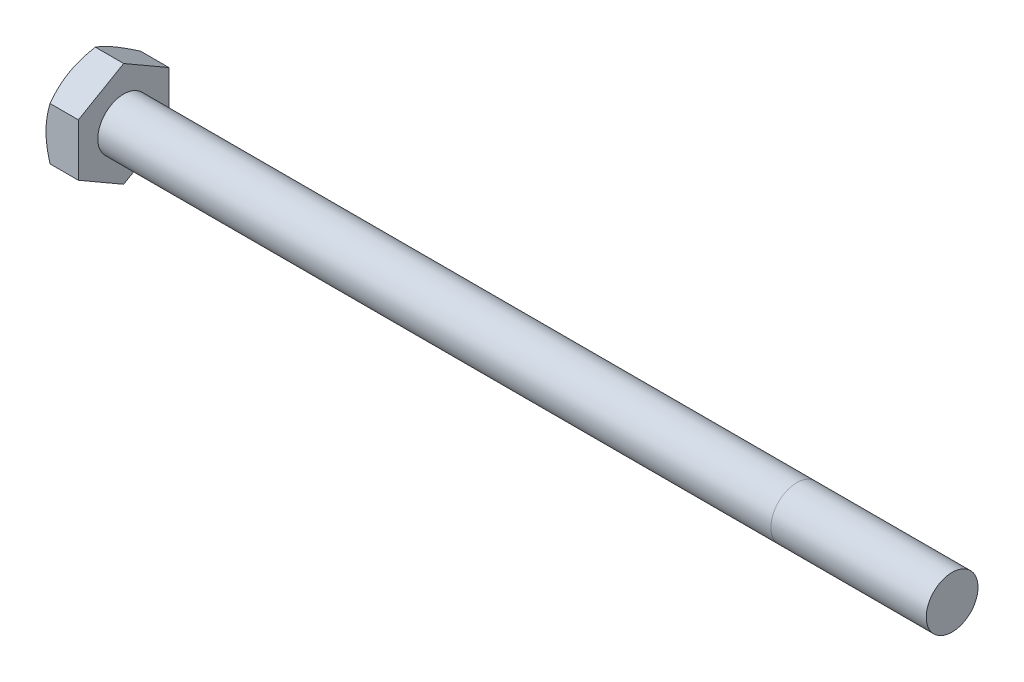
ISO-10303-21;
HEADER;
FILE_DESCRIPTION(('STEP AP214'),'2;1');
FILE_NAME('part.step','',(''),(''),'','','');
FILE_SCHEMA(('AUTOMOTIVE_DESIGN { 1 0 10303 214 1 1 1 1 }'));
ENDSEC;
DATA;
#1=APPLICATION_CONTEXT('core data for automotive mechanical design processes');
#2=APPLICATION_PROTOCOL_DEFINITION('international standard','automotive_design',2000,#1);
#3=PRODUCT_CONTEXT('',#1,'mechanical');
#4=PRODUCT('Part','Part','',(#3));
#5=PRODUCT_RELATED_PRODUCT_CATEGORY('part','',(#4));
#6=PRODUCT_DEFINITION_FORMATION('','',#4);
#7=PRODUCT_DEFINITION_CONTEXT('part definition',#1,'design');
#8=PRODUCT_DEFINITION('design','',#6,#7);
#9=PRODUCT_DEFINITION_SHAPE('','',#8);
#10=(LENGTH_UNIT() NAMED_UNIT(*) SI_UNIT(.MILLI.,.METRE.));
#11=(NAMED_UNIT(*) PLANE_ANGLE_UNIT() SI_UNIT($,.RADIAN.));
#12=(NAMED_UNIT(*) SI_UNIT($,.STERADIAN.) SOLID_ANGLE_UNIT());
#13=UNCERTAINTY_MEASURE_WITH_UNIT(LENGTH_MEASURE(1.E-05),#10,'distance_accuracy_value','');
#14=(GEOMETRIC_REPRESENTATION_CONTEXT(3) GLOBAL_UNCERTAINTY_ASSIGNED_CONTEXT((#13)) GLOBAL_UNIT_ASSIGNED_CONTEXT((#10,
#11,#12)) REPRESENTATION_CONTEXT('',''));
#15=CARTESIAN_POINT('',(0.,0.,0.));
#16=DIRECTION('',(0.,0.,1.));
#17=DIRECTION('',(1.,0.,0.));
#18=AXIS2_PLACEMENT_3D('',#15,#16,#17);
#19=CARTESIAN_POINT('',(-48.815625,0.,0.));
#20=DIRECTION('',(1.,0.,0.));
#21=DIRECTION('',(0.,0.,-1.));
#22=AXIS2_PLACEMENT_3D('',#19,#20,#21);
#23=CYLINDRICAL_SURFACE('',#22,3.175);
#24=CARTESIAN_POINT('',(52.784375,0.,0.));
#25=DIRECTION('',(1.,0.,0.));
#26=DIRECTION('',(0.,0.,-1.));
#27=AXIS2_PLACEMENT_3D('',#24,#25,#26);
#28=CIRCLE('',#27,3.175);
#29=CARTESIAN_POINT('',(52.784375,0.,-3.175));
#30=VERTEX_POINT('',#29);
#31=EDGE_CURVE('E384',#30,#30,#28,.T.);
#32=ORIENTED_EDGE('',*,*,#31,.F.);
#33=EDGE_LOOP('',(#32));
#34=FACE_BOUND('',#33,.T.);
#35=CARTESIAN_POINT('',(33.734375,0.,0.));
#36=DIRECTION('',(-1.,0.,0.));
#37=DIRECTION('',(0.,0.,1.));
#38=AXIS2_PLACEMENT_3D('',#35,#36,#37);
#39=CIRCLE('',#38,3.175);
#40=CARTESIAN_POINT('',(33.734375,0.,-3.175));
#41=VERTEX_POINT('',#40);
#42=CARTESIAN_POINT('',(33.734375,0.,3.175));
#43=VERTEX_POINT('',#42);
#44=EDGE_CURVE('E40',#41,#43,#39,.F.);
#45=ORIENTED_EDGE('',*,*,#44,.T.);
#46=EDGE_CURVE('E12',#43,#41,#39,.F.);
#47=ORIENTED_EDGE('',*,*,#46,.T.);
#48=EDGE_LOOP('',(#45,#47));
#49=FACE_BOUND('',#48,.T.);
#50=ADVANCED_FACE('F36',(#34,#49),#23,.T.);
#51=CARTESIAN_POINT('',(-52.784375,-3.20790243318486,5.55625));
#52=DIRECTION('',(0.,0.,-1.));
#53=DIRECTION('',(0.,1.,0.));
#54=AXIS2_PLACEMENT_3D('',#51,#52,#53);
#55=PLANE('',#54);
#56=CARTESIAN_POINT('',(-50.0245843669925,-8.71597197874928,5.55625));
#57=CARTESIAN_POINT('',(-50.1431276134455,-8.4724129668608,5.55625));
#58=CARTESIAN_POINT('',(-50.2605624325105,-8.22830532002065,5.55625));
#59=CARTESIAN_POINT('',(-50.4925936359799,-7.73870131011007,5.55625));
#60=CARTESIAN_POINT('',(-50.6071895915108,-7.49320474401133,5.55625));
#61=CARTESIAN_POINT('',(-50.8334767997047,-6.99931388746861,5.55625));
#62=CARTESIAN_POINT('',(-50.9451496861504,-6.75091115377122,5.55625));
#63=CARTESIAN_POINT('',(-51.1640550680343,-6.25216399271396,5.55625));
#64=CARTESIAN_POINT('',(-51.2712877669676,-6.00181965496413,5.55625));
#65=CARTESIAN_POINT('',(-51.4836259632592,-5.49040404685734,5.55625));
#66=CARTESIAN_POINT('',(-51.5885413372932,-5.22925341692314,5.55625));
#67=CARTESIAN_POINT('',(-51.7906690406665,-4.70393363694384,5.55625));
#68=CARTESIAN_POINT('',(-51.8878805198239,-4.43976415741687,5.55625));
#69=CARTESIAN_POINT('',(-52.072121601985,-3.90845027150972,5.55625));
#70=CARTESIAN_POINT('',(-52.1591709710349,-3.64131278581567,5.55625));
#71=CARTESIAN_POINT('',(-52.3203596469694,-3.10320429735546,5.55625));
#72=CARTESIAN_POINT('',(-52.3945029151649,-2.83223449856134,5.55625));
#73=CARTESIAN_POINT('',(-52.5259992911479,-2.28781102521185,5.55625));
#74=CARTESIAN_POINT('',(-52.5834450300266,-2.01438008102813,5.55625));
#75=CARTESIAN_POINT('',(-52.6783467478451,-1.46397793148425,5.55625));
#76=CARTESIAN_POINT('',(-52.7158048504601,-1.18700710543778,5.55625));
#77=CARTESIAN_POINT('',(-52.754519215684,-0.771839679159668,5.55625));
#78=CARTESIAN_POINT('',(-52.764501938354,-0.634423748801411,5.55625));
#79=CARTESIAN_POINT('',(-52.7786468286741,-0.359297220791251,5.55625));
#80=CARTESIAN_POINT('',(-52.7828095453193,-0.221586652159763,5.55625));
#81=CARTESIAN_POINT('',(-52.785210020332,0.0538978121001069,5.55625));
#82=CARTESIAN_POINT('',(-52.7834472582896,0.191671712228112,5.55625));
#83=CARTESIAN_POINT('',(-52.7740420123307,0.467008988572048,5.55625));
#84=CARTESIAN_POINT('',(-52.7663997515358,0.604572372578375,5.55625));
#85=CARTESIAN_POINT('',(-52.7413631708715,0.932168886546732,5.55625));
#86=CARTESIAN_POINT('',(-52.721346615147,1.12200607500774,5.55625));
#87=CARTESIAN_POINT('',(-52.6711855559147,1.50032750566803,5.55625));
#88=CARTESIAN_POINT('',(-52.6410397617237,1.68881157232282,5.55625));
#89=CARTESIAN_POINT('',(-52.5370024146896,2.25198169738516,5.55625));
#90=CARTESIAN_POINT('',(-52.4495274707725,2.62419475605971,5.55625));
#91=CARTESIAN_POINT('',(-52.2970938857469,3.18100797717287,5.55625));
#92=CARTESIAN_POINT('',(-52.241996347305,3.36847421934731,5.55625));
#93=CARTESIAN_POINT('',(-52.1258963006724,3.74158722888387,5.55625));
#94=CARTESIAN_POINT('',(-52.0648937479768,3.92723398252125,5.55625));
#95=CARTESIAN_POINT('',(-51.9379776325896,4.29676489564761,5.55625));
#96=CARTESIAN_POINT('',(-51.8720655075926,4.4806495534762,5.55625));
#97=CARTESIAN_POINT('',(-51.7361240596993,4.84688123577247,5.55625));
#98=CARTESIAN_POINT('',(-51.6660948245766,5.02922829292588,5.55625));
#99=CARTESIAN_POINT('',(-51.4751931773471,5.51260356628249,5.55625));
#100=CARTESIAN_POINT('',(-51.3513007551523,5.81243784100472,5.55625));
#101=CARTESIAN_POINT('',(-51.0964246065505,6.40908803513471,5.55625));
#102=CARTESIAN_POINT('',(-50.9654401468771,6.7059036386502,5.55625));
#103=CARTESIAN_POINT('',(-50.6980293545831,7.29719434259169,5.55625));
#104=CARTESIAN_POINT('',(-50.5616010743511,7.5916685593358,5.55625));
#105=CARTESIAN_POINT('',(-50.2845811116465,8.17863206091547,5.55625));
#106=CARTESIAN_POINT('',(-50.1439895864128,8.47112142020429,5.55625));
#107=CARTESIAN_POINT('',(-49.859318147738,9.05495036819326,5.55625));
#108=CARTESIAN_POINT('',(-49.7152332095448,9.34628750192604,5.55625));
#109=CARTESIAN_POINT('',(-49.4244465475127,9.92765328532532,5.55625));
#110=CARTESIAN_POINT('',(-49.2777448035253,10.2176819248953,5.55625));
#111=CARTESIAN_POINT('',(-48.8345640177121,11.0860438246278,5.55625));
#112=CARTESIAN_POINT('',(-48.5349489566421,11.6627758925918,5.55625));
#113=CARTESIAN_POINT('',(-47.9612850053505,12.7539662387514,5.55625));
#114=CARTESIAN_POINT('',(-47.6877850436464,13.2687144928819,5.55625));
#115=CARTESIAN_POINT('',(-47.1374510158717,14.2964629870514,5.55625));
#116=CARTESIAN_POINT('',(-46.8606167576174,14.8094631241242,5.55625));
#117=CARTESIAN_POINT('',(-46.3053732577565,15.8324606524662,5.55625));
#118=CARTESIAN_POINT('',(-46.0269720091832,16.3424623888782,5.55625));
#119=CARTESIAN_POINT('',(-45.4682670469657,17.3613731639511,5.55625));
#120=CARTESIAN_POINT('',(-45.1879634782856,17.8702822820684,5.55625));
#121=CARTESIAN_POINT('',(-44.9069657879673,18.3788054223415,5.55625));
#122=B_SPLINE_CURVE_WITH_KNOTS('',3,(#56,#57,#58,#59,#60,#61,#62,#63,#64,#65,#66,#67,#68,#69,
#70,#71,#72,#73,#74,#75,#76,#77,#78,#79,#80,#81,#82,#83,#84,#85,#86,#87,#88,#89,#90,#91,#92,#93,
#94,#95,#96,#97,#98,#99,#100,#101,#102,#103,#104,#105,#106,#107,#108,#109,#110,#111,#112,#113,
#114,#115,#116,#117,#118,#119,#120,#121),.UNSPECIFIED.,.F.,.F.,(4,2,2,2,2,2,2,2,2,2,2,2,2,2,2,2,
2,2,2,2,2,2,2,2,2,2,2,2,2,2,2,2,4),(0.,0.812635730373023,1.62539348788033,2.44240990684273,
3.25938884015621,4.103606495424,4.9479171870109,5.79055726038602,6.63293824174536,
7.47055271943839,8.30807818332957,8.72130785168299,9.13449853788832,9.54772551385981,
9.96093680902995,10.5332843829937,11.1057049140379,12.2511183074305,12.8372525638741,
13.4233912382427,14.0093589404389,14.5953141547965,15.5684465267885,16.541679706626,
17.5152642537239,18.4888120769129,19.4638547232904,20.4389048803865,22.3885945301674,
24.1372706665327,25.886048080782,27.6291677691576,29.3721560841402),.UNSPECIFIED.);
#123=CARTESIAN_POINT('',(-52.2881107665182,-3.20790243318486,5.55625));
#124=VERTEX_POINT('',#123);
#125=CARTESIAN_POINT('',(-52.784375,0.,5.55625));
#126=VERTEX_POINT('',#125);
#127=EDGE_CURVE('E434',#124,#126,#122,.T.);
#128=ORIENTED_EDGE('',*,*,#127,.F.);
#129=DIRECTION('',(1.,0.,0.));
#130=VECTOR('',#129,1.);
#131=CARTESIAN_POINT('',(-52.784375,-3.20790243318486,5.55625));
#132=LINE('',#131,#130);
#133=CARTESIAN_POINT('',(-48.815625,-3.20790243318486,5.55625));
#134=VERTEX_POINT('',#133);
#135=EDGE_CURVE('E416',#124,#134,#132,.T.);
#136=ORIENTED_EDGE('',*,*,#135,.T.);
#137=DIRECTION('',(0.,1.,0.));
#138=VECTOR('',#137,1.);
#139=CARTESIAN_POINT('',(-48.815625,-3.20790243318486,5.55625));
#140=LINE('',#139,#138);
#141=CARTESIAN_POINT('',(-48.815625,3.20790243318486,5.55625));
#142=VERTEX_POINT('',#141);
#143=EDGE_CURVE('E432',#134,#142,#140,.T.);
#144=ORIENTED_EDGE('',*,*,#143,.T.);
#145=DIRECTION('',(1.,0.,0.));
#146=VECTOR('',#145,1.);
#147=CARTESIAN_POINT('',(-52.784375,3.20790243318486,5.55625));
#148=LINE('',#147,#146);
#149=CARTESIAN_POINT('',(-52.2881107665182,3.20790243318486,5.55625));
#150=VERTEX_POINT('',#149);
#151=EDGE_CURVE('E404',#150,#142,#148,.T.);
#152=ORIENTED_EDGE('',*,*,#151,.F.);
#153=EDGE_CURVE('E324',#126,#150,#122,.T.);
#154=ORIENTED_EDGE('',*,*,#153,.F.);
#155=EDGE_LOOP('',(#128,#136,#144,#152,#154));
#156=FACE_BOUND('',#155,.T.);
#157=ADVANCED_FACE('F365',(#156),#55,.F.);
#158=CARTESIAN_POINT('',(-52.784375,3.20790243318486,5.55625));
#159=DIRECTION('',(0.,-0.866025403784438,-0.5));
#160=DIRECTION('',(0.,0.5,-0.866025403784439));
#161=AXIS2_PLACEMENT_3D('',#158,#159,#160);
#162=PLANE('',#161);
#163=CARTESIAN_POINT('',(-52.2880440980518,3.20778696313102,5.55645));
#164=CARTESIAN_POINT('',(-52.3287494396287,3.27830048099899,5.43431700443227));
#165=CARTESIAN_POINT('',(-52.3676074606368,3.34907690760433,5.31172863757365));
#166=CARTESIAN_POINT('',(-52.4411200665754,3.49120454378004,5.06555635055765));
#167=CARTESIAN_POINT('',(-52.4757728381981,3.56255598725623,4.94197202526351));
#168=CARTESIAN_POINT('',(-52.5727431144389,3.7777527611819,4.56924027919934));
#169=CARTESIAN_POINT('',(-52.627898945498,3.92244755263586,4.3186215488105));
#170=CARTESIAN_POINT('',(-52.692576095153,4.13898067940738,3.94357517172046));
#171=CARTESIAN_POINT('',(-52.7110008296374,4.21017202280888,3.82026814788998));
#172=CARTESIAN_POINT('',(-52.7418966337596,4.35287639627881,3.57309692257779));
#173=CARTESIAN_POINT('',(-52.754368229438,4.42438939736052,3.44923277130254));
#174=CARTESIAN_POINT('',(-52.7730399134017,4.56753961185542,3.20128932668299));
#175=CARTESIAN_POINT('',(-52.7792471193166,4.63917659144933,3.07721043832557));
#176=CARTESIAN_POINT('',(-52.7852635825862,4.7825127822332,2.82894487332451));
#177=CARTESIAN_POINT('',(-52.7850730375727,4.85421199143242,2.70475820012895));
#178=CARTESIAN_POINT('',(-52.7757567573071,5.05064720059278,2.3645224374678));
#179=CARTESIAN_POINT('',(-52.7601153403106,5.1753189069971,2.14858470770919));
#180=CARTESIAN_POINT('',(-52.7105150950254,5.42383425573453,1.71814349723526));
#181=CARTESIAN_POINT('',(-52.6765393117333,5.54767702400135,1.50364153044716));
#182=CARTESIAN_POINT('',(-52.5916092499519,5.79669255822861,1.07233397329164));
#183=CARTESIAN_POINT('',(-52.5402951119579,5.92183390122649,0.8555828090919));
#184=CARTESIAN_POINT('',(-52.4238325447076,6.17025031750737,0.425312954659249));
#185=CARTESIAN_POINT('',(-52.3587114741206,6.29352857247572,0.211788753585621));
#186=CARTESIAN_POINT('',(-52.2880440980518,6.41592033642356,-0.00020000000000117));
#187=B_SPLINE_CURVE_WITH_KNOTS('',3,(#163,#164,#165,#166,#167,#168,#169,#170,#171,#172,#173,
#174,#175,#176,#177,#178,#179,#180,#181,#182,#183,#184,#185,#186),.UNSPECIFIED.,.F.,.F.,(4,2,2,
2,2,2,2,2,2,2,2,4),(0.,0.440316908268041,0.880823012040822,1.76366572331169,2.19427472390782,
2.62484566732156,3.05492684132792,3.48499472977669,4.23370964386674,4.98311813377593,
5.74914806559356,6.51367405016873),.UNSPECIFIED.);
#188=CARTESIAN_POINT('',(-52.784375,4.81185364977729,2.778125));
#189=VERTEX_POINT('',#188);
#190=EDGE_CURVE('E439',#150,#189,#187,.T.);
#191=ORIENTED_EDGE('',*,*,#190,.F.);
#192=ORIENTED_EDGE('',*,*,#151,.T.);
#193=DIRECTION('',(0.,0.5,-0.866025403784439));
#194=VECTOR('',#193,1.);
#195=CARTESIAN_POINT('',(-48.815625,3.20790243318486,5.55625));
#196=LINE('',#195,#194);
#197=CARTESIAN_POINT('',(-48.815625,6.41580486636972,0.));
#198=VERTEX_POINT('',#197);
#199=EDGE_CURVE('E430',#142,#198,#196,.T.);
#200=ORIENTED_EDGE('',*,*,#199,.T.);
#201=DIRECTION('',(1.,0.,0.));
#202=VECTOR('',#201,1.);
#203=CARTESIAN_POINT('',(-52.784375,6.41580486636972,0.));
#204=LINE('',#203,#202);
#205=CARTESIAN_POINT('',(-52.2881107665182,6.41580486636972,0.));
#206=VERTEX_POINT('',#205);
#207=EDGE_CURVE('E408',#206,#198,#204,.T.);
#208=ORIENTED_EDGE('',*,*,#207,.F.);
#209=EDGE_CURVE('E350',#189,#206,#187,.T.);
#210=ORIENTED_EDGE('',*,*,#209,.F.);
#211=EDGE_LOOP('',(#191,#192,#200,#208,#210));
#212=FACE_BOUND('',#211,.T.);
#213=ADVANCED_FACE('F360',(#212),#162,.F.);
#214=CARTESIAN_POINT('',(-52.784375,6.41580486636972,0.));
#215=DIRECTION('',(0.,-0.866025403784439,0.5));
#216=DIRECTION('',(0.,-0.5,-0.866025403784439));
#217=AXIS2_PLACEMENT_3D('',#214,#215,#216);
#218=PLANE('',#217);
#219=CARTESIAN_POINT('',(-52.2880440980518,6.41592033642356,0.000199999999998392));
#220=CARTESIAN_POINT('',(-52.3287494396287,6.34540681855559,-0.121932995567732));
#221=CARTESIAN_POINT('',(-52.3676074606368,6.27463039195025,-0.244521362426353));
#222=CARTESIAN_POINT('',(-52.4411200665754,6.13250275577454,-0.490693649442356));
#223=CARTESIAN_POINT('',(-52.4757728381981,6.06115131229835,-0.614277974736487));
#224=CARTESIAN_POINT('',(-52.5727431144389,5.84595453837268,-0.987009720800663));
#225=CARTESIAN_POINT('',(-52.6278989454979,5.70125974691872,-1.2376284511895));
#226=CARTESIAN_POINT('',(-52.692576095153,5.4847266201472,-1.61267482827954));
#227=CARTESIAN_POINT('',(-52.7110008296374,5.41353527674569,-1.73598185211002));
#228=CARTESIAN_POINT('',(-52.7418966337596,5.27083090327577,-1.98315307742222));
#229=CARTESIAN_POINT('',(-52.754368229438,5.19931790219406,-2.10701722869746));
#230=CARTESIAN_POINT('',(-52.7730399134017,5.05616768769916,-2.35496067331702));
#231=CARTESIAN_POINT('',(-52.7792471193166,4.98453070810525,-2.47903956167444));
#232=CARTESIAN_POINT('',(-52.7852635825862,4.84119451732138,-2.72730512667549));
#233=CARTESIAN_POINT('',(-52.7850730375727,4.76949530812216,-2.85149179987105));
#234=CARTESIAN_POINT('',(-52.7757567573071,4.5730600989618,-3.19172756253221));
#235=CARTESIAN_POINT('',(-52.7601153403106,4.44838839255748,-3.40766529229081));
#236=CARTESIAN_POINT('',(-52.7105150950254,4.19987304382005,-3.83810650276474));
#237=CARTESIAN_POINT('',(-52.6765393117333,4.07603027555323,-4.05260846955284));
#238=CARTESIAN_POINT('',(-52.5916092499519,3.82701474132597,-4.48391602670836));
#239=CARTESIAN_POINT('',(-52.5402951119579,3.70187339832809,-4.7006671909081));
#240=CARTESIAN_POINT('',(-52.4238325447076,3.45345698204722,-5.13093704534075));
#241=CARTESIAN_POINT('',(-52.3587114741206,3.33017872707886,-5.34446124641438));
#242=CARTESIAN_POINT('',(-52.2880440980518,3.20778696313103,-5.55645));
#243=B_SPLINE_CURVE_WITH_KNOTS('',3,(#219,#220,#221,#222,#223,#224,#225,#226,#227,#228,#229,
#230,#231,#232,#233,#234,#235,#236,#237,#238,#239,#240,#241,#242),.UNSPECIFIED.,.F.,.F.,(4,2,2,
2,2,2,2,2,2,2,2,4),(0.,0.440316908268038,0.88082301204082,1.76366572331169,2.19427472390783,
2.62484566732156,3.05492684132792,3.48499472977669,4.23370964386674,4.98311813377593,
5.74914806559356,6.51367405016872),.UNSPECIFIED.);
#244=CARTESIAN_POINT('',(-52.784375,4.81185364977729,-2.778125));
#245=VERTEX_POINT('',#244);
#246=EDGE_CURVE('E348',#206,#245,#243,.T.);
#247=ORIENTED_EDGE('',*,*,#246,.F.);
#248=ORIENTED_EDGE('',*,*,#207,.T.);
#249=DIRECTION('',(0.,-0.5,-0.866025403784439));
#250=VECTOR('',#249,1.);
#251=CARTESIAN_POINT('',(-48.815625,6.41580486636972,0.));
#252=LINE('',#251,#250);
#253=CARTESIAN_POINT('',(-48.815625,3.20790243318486,-5.55625));
#254=VERTEX_POINT('',#253);
#255=EDGE_CURVE('E427',#198,#254,#252,.T.);
#256=ORIENTED_EDGE('',*,*,#255,.T.);
#257=DIRECTION('',(1.,0.,0.));
#258=VECTOR('',#257,1.);
#259=CARTESIAN_POINT('',(-52.784375,3.20790243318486,-5.55625));
#260=LINE('',#259,#258);
#261=CARTESIAN_POINT('',(-52.2881107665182,3.20790243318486,-5.55625));
#262=VERTEX_POINT('',#261);
#263=EDGE_CURVE('E410',#262,#254,#260,.T.);
#264=ORIENTED_EDGE('',*,*,#263,.F.);
#265=EDGE_CURVE('E342',#245,#262,#243,.T.);
#266=ORIENTED_EDGE('',*,*,#265,.F.);
#267=EDGE_LOOP('',(#247,#248,#256,#264,#266));
#268=FACE_BOUND('',#267,.T.);
#269=ADVANCED_FACE('F356',(#268),#218,.F.);
#270=CARTESIAN_POINT('',(-52.784375,3.20790243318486,-5.55625));
#271=DIRECTION('',(0.,0.,1.));
#272=DIRECTION('',(0.,-1.,0.));
#273=AXIS2_PLACEMENT_3D('',#270,#271,#272);
#274=PLANE('',#273);
#275=CARTESIAN_POINT('',(-50.024584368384,-8.71597197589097,-5.55625));
#276=CARTESIAN_POINT('',(-50.143127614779,-8.47241296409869,-5.55625));
#277=CARTESIAN_POINT('',(-50.260562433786,-8.22830531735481,-5.55625));
#278=CARTESIAN_POINT('',(-50.4925936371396,-7.73870130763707,-5.55625));
#279=CARTESIAN_POINT('',(-50.6071895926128,-7.4932047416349,-5.55625));
#280=CARTESIAN_POINT('',(-50.8334768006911,-6.99931388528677,-5.55625));
#281=CARTESIAN_POINT('',(-50.9451496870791,-6.75091115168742,-5.55625));
#282=CARTESIAN_POINT('',(-51.1640550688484,-6.25216399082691,-5.55625));
#283=CARTESIAN_POINT('',(-51.2712877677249,-6.00181965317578,-5.55625));
#284=CARTESIAN_POINT('',(-51.4836259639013,-5.49040404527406,-5.55625));
#285=CARTESIAN_POINT('',(-51.5885413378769,-5.22925341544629,-5.55625));
#286=CARTESIAN_POINT('',(-51.7906690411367,-4.70393363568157,-5.55625));
#287=CARTESIAN_POINT('',(-51.8878805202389,-4.43976415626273,-5.55625));
#288=CARTESIAN_POINT('',(-52.0721216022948,-3.90845027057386,-5.55625));
#289=CARTESIAN_POINT('',(-52.1591709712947,-3.64131278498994,-5.55625));
#290=CARTESIAN_POINT('',(-52.3203596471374,-3.103204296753,-5.55625));
#291=CARTESIAN_POINT('',(-52.394502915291,-2.83223449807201,-5.55625));
#292=CARTESIAN_POINT('',(-52.5259992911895,-2.28781102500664,-5.55625));
#293=CARTESIAN_POINT('',(-52.5834450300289,-2.01438008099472,-5.55625));
#294=CARTESIAN_POINT('',(-52.6783467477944,-1.46397793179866,-5.55625));
#295=CARTESIAN_POINT('',(-52.7158048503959,-1.18700710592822,-5.55625));
#296=CARTESIAN_POINT('',(-52.7545192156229,-0.77183967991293,-5.55625));
#297=CARTESIAN_POINT('',(-52.7645019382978,-0.634423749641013,-5.55625));
#298=CARTESIAN_POINT('',(-52.7786468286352,-0.359297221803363,-5.55625));
#299=CARTESIAN_POINT('',(-52.7828095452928,-0.221586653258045,-5.55625));
#300=CARTESIAN_POINT('',(-52.7852100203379,0.0538978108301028,-5.55625));
#301=CARTESIAN_POINT('',(-52.7834472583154,0.191671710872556,-5.55625));
#302=CARTESIAN_POINT('',(-52.7740420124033,0.467008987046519,-5.55625));
#303=CARTESIAN_POINT('',(-52.7663997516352,0.604572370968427,-5.55625));
#304=CARTESIAN_POINT('',(-52.7413631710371,0.932168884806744,-5.55625));
#305=CARTESIAN_POINT('',(-52.7213466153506,1.1220060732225,-5.55625));
#306=CARTESIAN_POINT('',(-52.6711855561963,1.50032750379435,-5.55625));
#307=CARTESIAN_POINT('',(-52.6410397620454,1.68881157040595,-5.55625));
#308=CARTESIAN_POINT('',(-52.5370024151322,2.25198169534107,-5.55625));
#309=CARTESIAN_POINT('',(-52.4495274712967,2.62419475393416,-5.55625));
#310=CARTESIAN_POINT('',(-52.2970938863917,3.18100797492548,-5.55625));
#311=CARTESIAN_POINT('',(-52.2419963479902,3.36847421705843,-5.55625));
#312=CARTESIAN_POINT('',(-52.1258963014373,3.74158722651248,-5.55625));
#313=CARTESIAN_POINT('',(-52.0648937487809,3.92723398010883,-5.55625));
#314=CARTESIAN_POINT('',(-51.9379776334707,4.29676489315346,-5.55625));
#315=CARTESIAN_POINT('',(-51.8720655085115,4.48064955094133,-5.55625));
#316=CARTESIAN_POINT('',(-51.7361240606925,4.84688123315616,-5.55625));
#317=CARTESIAN_POINT('',(-51.6660948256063,5.02922829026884,-5.55625));
#318=CARTESIAN_POINT('',(-51.4751931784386,5.51260356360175,-5.55625));
#319=CARTESIAN_POINT('',(-51.3513007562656,5.81243783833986,-5.55625));
#320=CARTESIAN_POINT('',(-51.0964246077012,6.40908803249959,-5.55625));
#321=CARTESIAN_POINT('',(-50.9654401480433,6.70590363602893,-5.55625));
#322=CARTESIAN_POINT('',(-50.6980293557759,7.29719433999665,-5.55625));
#323=CARTESIAN_POINT('',(-50.5616010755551,7.59166855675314,-5.55625));
#324=CARTESIAN_POINT('',(-50.2845811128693,8.17863205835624,-5.55625));
#325=CARTESIAN_POINT('',(-50.1439895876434,8.47112141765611,-5.55625));
#326=CARTESIAN_POINT('',(-49.8593181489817,9.05495036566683,-5.55625));
#327=CARTESIAN_POINT('',(-49.7152332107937,9.34628749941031,-5.55625));
#328=CARTESIAN_POINT('',(-49.4244465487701,9.92765328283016,-5.55625));
#329=CARTESIAN_POINT('',(-49.2777448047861,10.2176819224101,-5.55625));
#330=CARTESIAN_POINT('',(-48.8345640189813,11.086043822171,-5.55625));
#331=CARTESIAN_POINT('',(-48.5349489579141,11.6627758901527,-5.55625));
#332=CARTESIAN_POINT('',(-47.9612850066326,12.75396623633,-5.55625));
#333=CARTESIAN_POINT('',(-47.6877850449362,13.2687144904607,-5.55625));
#334=CARTESIAN_POINT('',(-47.1374510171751,14.2964629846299,-5.55625));
#335=CARTESIAN_POINT('',(-46.8606167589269,14.8094631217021,-5.55625));
#336=CARTESIAN_POINT('',(-46.3053732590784,15.8324606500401,-5.55625));
#337=CARTESIAN_POINT('',(-46.0269720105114,16.3424623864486,-5.55625));
#338=CARTESIAN_POINT('',(-45.4682670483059,17.3613731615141,-5.55625));
#339=CARTESIAN_POINT('',(-45.1879634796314,17.8702822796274,-5.55625));
#340=CARTESIAN_POINT('',(-44.9069657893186,18.3788054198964,-5.55625));
#341=B_SPLINE_CURVE_WITH_KNOTS('',3,(#275,#276,#277,#278,#279,#280,#281,#282,#283,#284,#285,
#286,#287,#288,#289,#290,#291,#292,#293,#294,#295,#296,#297,#298,#299,#300,#301,#302,#303,#304,
#305,#306,#307,#308,#309,#310,#311,#312,#313,#314,#315,#316,#317,#318,#319,#320,#321,#322,#323,
#324,#325,#326,#327,#328,#329,#330,#331,#332,#333,#334,#335,#336,#337,#338,#339,#340),
.UNSPECIFIED.,.F.,.F.,(4,2,2,2,2,2,2,2,2,2,2,2,2,2,2,2,2,2,2,2,2,2,2,2,2,2,2,2,2,2,2,2,4),(0.,
0.812635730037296,1.62539348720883,2.44240990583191,3.25938883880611,4.10360649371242,
4.94791718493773,5.79055725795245,6.63293823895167,7.4705527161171,8.30807817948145,
8.72130784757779,9.13449853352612,9.54772550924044,9.96093680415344,10.5332843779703,
11.1057049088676,12.2511183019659,12.8372525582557,13.4233912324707,14.0093589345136,
14.5953141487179,15.5684465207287,16.5416797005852,17.5152642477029,18.4888120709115,
19.4638547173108,20.4389048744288,22.3885945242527,24.1372706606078,25.8860480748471,
27.6291677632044,29.3721560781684),.UNSPECIFIED.);
#342=CARTESIAN_POINT('',(-52.784375,0.,-5.55625));
#343=VERTEX_POINT('',#342);
#344=EDGE_CURVE('E349',#262,#343,#341,.F.);
#345=ORIENTED_EDGE('',*,*,#344,.F.);
#346=ORIENTED_EDGE('',*,*,#263,.T.);
#347=DIRECTION('',(0.,-1.,0.));
#348=VECTOR('',#347,1.);
#349=CARTESIAN_POINT('',(-48.815625,3.20790243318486,-5.55625));
#350=LINE('',#349,#348);
#351=CARTESIAN_POINT('',(-48.815625,-3.20790243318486,-5.55625));
#352=VERTEX_POINT('',#351);
#353=EDGE_CURVE('E424',#254,#352,#350,.T.);
#354=ORIENTED_EDGE('',*,*,#353,.T.);
#355=DIRECTION('',(1.,0.,0.));
#356=VECTOR('',#355,1.);
#357=CARTESIAN_POINT('',(-52.784375,-3.20790243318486,-5.55625));
#358=LINE('',#357,#356);
#359=CARTESIAN_POINT('',(-52.2881107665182,-3.20790243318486,-5.55625));
#360=VERTEX_POINT('',#359);
#361=EDGE_CURVE('E412',#360,#352,#358,.T.);
#362=ORIENTED_EDGE('',*,*,#361,.F.);
#363=EDGE_CURVE('E335',#343,#360,#341,.F.);
#364=ORIENTED_EDGE('',*,*,#363,.F.);
#365=EDGE_LOOP('',(#345,#346,#354,#362,#364));
#366=FACE_BOUND('',#365,.T.);
#367=ADVANCED_FACE('F359',(#366),#274,.F.);
#368=CARTESIAN_POINT('',(-52.784375,-3.20790243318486,-5.55625));
#369=DIRECTION('',(0.,0.866025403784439,0.5));
#370=DIRECTION('',(0.,-0.5,0.866025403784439));
#371=AXIS2_PLACEMENT_3D('',#368,#369,#370);
#372=PLANE('',#371);
#373=CARTESIAN_POINT('',(-52.2880440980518,-3.20778696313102,-5.55645));
#374=CARTESIAN_POINT('',(-52.3287494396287,-3.27830048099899,-5.43431700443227));
#375=CARTESIAN_POINT('',(-52.3676074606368,-3.34907690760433,-5.31172863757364));
#376=CARTESIAN_POINT('',(-52.4411200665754,-3.49120454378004,-5.06555635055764));
#377=CARTESIAN_POINT('',(-52.4757728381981,-3.56255598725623,-4.94197202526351));
#378=CARTESIAN_POINT('',(-52.5727431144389,-3.7777527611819,-4.56924027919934));
#379=CARTESIAN_POINT('',(-52.627898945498,-3.92244755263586,-4.3186215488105));
#380=CARTESIAN_POINT('',(-52.692576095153,-4.13898067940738,-3.94357517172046));
#381=CARTESIAN_POINT('',(-52.7110008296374,-4.21017202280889,-3.82026814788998));
#382=CARTESIAN_POINT('',(-52.7418966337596,-4.35287639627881,-3.57309692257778));
#383=CARTESIAN_POINT('',(-52.754368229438,-4.42438939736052,-3.44923277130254));
#384=CARTESIAN_POINT('',(-52.7730399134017,-4.56753961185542,-3.20128932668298));
#385=CARTESIAN_POINT('',(-52.7792471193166,-4.63917659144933,-3.07721043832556));
#386=CARTESIAN_POINT('',(-52.7852635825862,-4.7825127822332,-2.82894487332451));
#387=CARTESIAN_POINT('',(-52.7850730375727,-4.85421199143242,-2.70475820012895));
#388=CARTESIAN_POINT('',(-52.7757567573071,-5.05064720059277,-2.36452243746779));
#389=CARTESIAN_POINT('',(-52.7601153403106,-5.1753189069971,-2.14858470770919));
#390=CARTESIAN_POINT('',(-52.7105150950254,-5.42383425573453,-1.71814349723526));
#391=CARTESIAN_POINT('',(-52.6765393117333,-5.54767702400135,-1.50364153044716));
#392=CARTESIAN_POINT('',(-52.5916092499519,-5.79669255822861,-1.07233397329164));
#393=CARTESIAN_POINT('',(-52.5402951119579,-5.92183390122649,-0.855582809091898));
#394=CARTESIAN_POINT('',(-52.4238325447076,-6.17025031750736,-0.425312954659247));
#395=CARTESIAN_POINT('',(-52.3587114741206,-6.29352857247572,-0.211788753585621));
#396=CARTESIAN_POINT('',(-52.2880440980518,-6.41592033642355,0.000199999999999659));
#397=B_SPLINE_CURVE_WITH_KNOTS('',3,(#373,#374,#375,#376,#377,#378,#379,#380,#381,#382,#383,
#384,#385,#386,#387,#388,#389,#390,#391,#392,#393,#394,#395,#396),.UNSPECIFIED.,.F.,.F.,(4,2,2,
2,2,2,2,2,2,2,2,4),(0.,0.440316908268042,0.880823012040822,1.76366572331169,2.19427472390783,
2.62484566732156,3.05492684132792,3.48499472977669,4.23370964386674,4.98311813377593,
5.74914806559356,6.51367405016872),.UNSPECIFIED.);
#398=CARTESIAN_POINT('',(-52.784375,-4.81185364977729,-2.778125));
#399=VERTEX_POINT('',#398);
#400=EDGE_CURVE('E460',#360,#399,#397,.T.);
#401=ORIENTED_EDGE('',*,*,#400,.F.);
#402=ORIENTED_EDGE('',*,*,#361,.T.);
#403=DIRECTION('',(0.,-0.5,0.866025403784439));
#404=VECTOR('',#403,1.);
#405=CARTESIAN_POINT('',(-48.815625,-3.20790243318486,-5.55625));
#406=LINE('',#405,#404);
#407=CARTESIAN_POINT('',(-48.815625,-6.41580486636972,0.));
#408=VERTEX_POINT('',#407);
#409=EDGE_CURVE('E421',#352,#408,#406,.T.);
#410=ORIENTED_EDGE('',*,*,#409,.T.);
#411=DIRECTION('',(1.,0.,0.));
#412=VECTOR('',#411,1.);
#413=CARTESIAN_POINT('',(-52.784375,-6.41580486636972,0.));
#414=LINE('',#413,#412);
#415=CARTESIAN_POINT('',(-52.2881107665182,-6.41580486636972,0.));
#416=VERTEX_POINT('',#415);
#417=EDGE_CURVE('E414',#416,#408,#414,.T.);
#418=ORIENTED_EDGE('',*,*,#417,.F.);
#419=EDGE_CURVE('E299',#399,#416,#397,.T.);
#420=ORIENTED_EDGE('',*,*,#419,.F.);
#421=EDGE_LOOP('',(#401,#402,#410,#418,#420));
#422=FACE_BOUND('',#421,.T.);
#423=ADVANCED_FACE('F476',(#422),#372,.F.);
#424=CARTESIAN_POINT('',(-52.784375,-6.41580486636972,0.));
#425=DIRECTION('',(0.,0.866025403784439,-0.5));
#426=DIRECTION('',(0.,0.5,0.866025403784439));
#427=AXIS2_PLACEMENT_3D('',#424,#425,#426);
#428=PLANE('',#427);
#429=CARTESIAN_POINT('',(-52.2880440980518,-6.41592033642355,-0.00019999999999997));
#430=CARTESIAN_POINT('',(-52.3287494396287,-6.34540681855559,0.121932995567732));
#431=CARTESIAN_POINT('',(-52.3676074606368,-6.27463039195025,0.244521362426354));
#432=CARTESIAN_POINT('',(-52.4411200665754,-6.13250275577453,0.490693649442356));
#433=CARTESIAN_POINT('',(-52.4757728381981,-6.06115131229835,0.614277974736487));
#434=CARTESIAN_POINT('',(-52.5727431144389,-5.84595453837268,0.98700972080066));
#435=CARTESIAN_POINT('',(-52.627898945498,-5.70125974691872,1.2376284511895));
#436=CARTESIAN_POINT('',(-52.692576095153,-5.48472662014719,1.61267482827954));
#437=CARTESIAN_POINT('',(-52.7110008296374,-5.41353527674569,1.73598185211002));
#438=CARTESIAN_POINT('',(-52.7418966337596,-5.27083090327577,1.98315307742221));
#439=CARTESIAN_POINT('',(-52.754368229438,-5.19931790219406,2.10701722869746));
#440=CARTESIAN_POINT('',(-52.7730399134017,-5.05616768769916,2.35496067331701));
#441=CARTESIAN_POINT('',(-52.7792471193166,-4.98453070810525,2.47903956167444));
#442=CARTESIAN_POINT('',(-52.7852635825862,-4.84119451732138,2.72730512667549));
#443=CARTESIAN_POINT('',(-52.7850730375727,-4.76949530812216,2.85149179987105));
#444=CARTESIAN_POINT('',(-52.7757567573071,-4.5730600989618,3.1917275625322));
#445=CARTESIAN_POINT('',(-52.7601153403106,-4.44838839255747,3.40766529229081));
#446=CARTESIAN_POINT('',(-52.7105150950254,-4.19987304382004,3.83810650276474));
#447=CARTESIAN_POINT('',(-52.6765393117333,-4.07603027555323,4.05260846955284));
#448=CARTESIAN_POINT('',(-52.5916092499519,-3.82701474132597,4.48391602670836));
#449=CARTESIAN_POINT('',(-52.5402951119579,-3.70187339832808,4.7006671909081));
#450=CARTESIAN_POINT('',(-52.4238325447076,-3.45345698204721,5.13093704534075));
#451=CARTESIAN_POINT('',(-52.3587114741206,-3.33017872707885,5.34446124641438));
#452=CARTESIAN_POINT('',(-52.2880440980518,-3.20778696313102,5.55645));
#453=B_SPLINE_CURVE_WITH_KNOTS('',3,(#429,#430,#431,#432,#433,#434,#435,#436,#437,#438,#439,
#440,#441,#442,#443,#444,#445,#446,#447,#448,#449,#450,#451,#452),.UNSPECIFIED.,.F.,.F.,(4,2,2,
2,2,2,2,2,2,2,2,4),(0.,0.440316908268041,0.880823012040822,1.76366572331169,2.19427472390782,
2.62484566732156,3.05492684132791,3.48499472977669,4.23370964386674,4.98311813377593,
5.74914806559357,6.51367405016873),.UNSPECIFIED.);
#454=CARTESIAN_POINT('',(-52.784375,-4.81185364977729,2.778125));
#455=VERTEX_POINT('',#454);
#456=EDGE_CURVE('E298',#416,#455,#453,.T.);
#457=ORIENTED_EDGE('',*,*,#456,.F.);
#458=ORIENTED_EDGE('',*,*,#417,.T.);
#459=DIRECTION('',(0.,0.5,0.866025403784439));
#460=VECTOR('',#459,1.);
#461=CARTESIAN_POINT('',(-48.815625,-6.41580486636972,0.));
#462=LINE('',#461,#460);
#463=EDGE_CURVE('E418',#408,#134,#462,.T.);
#464=ORIENTED_EDGE('',*,*,#463,.T.);
#465=ORIENTED_EDGE('',*,*,#135,.F.);
#466=EDGE_CURVE('E290',#455,#124,#453,.T.);
#467=ORIENTED_EDGE('',*,*,#466,.F.);
#468=EDGE_LOOP('',(#457,#458,#464,#465,#467));
#469=FACE_BOUND('',#468,.T.);
#470=ADVANCED_FACE('F306',(#469),#428,.F.);
#471=ORIENTED_EDGE('',*,*,#46,.F.);
#472=ORIENTED_EDGE('',*,*,#44,.F.);
#473=EDGE_LOOP('',(#471,#472));
#474=FACE_BOUND('',#473,.T.);
#475=CARTESIAN_POINT('',(-48.815625,0.,0.));
#476=DIRECTION('',(-1.,0.,0.));
#477=DIRECTION('',(0.,0.,1.));
#478=AXIS2_PLACEMENT_3D('',#475,#476,#477);
#479=CIRCLE('',#478,3.175);
#480=CARTESIAN_POINT('',(-48.815625,0.,3.175));
#481=VERTEX_POINT('',#480);
#482=EDGE_CURVE('E402',#481,#481,#479,.F.);
#483=ORIENTED_EDGE('',*,*,#482,.T.);
#484=EDGE_LOOP('',(#483));
#485=FACE_BOUND('',#484,.T.);
#486=ADVANCED_FACE('F38',(#474,#485),#23,.T.);
#487=CARTESIAN_POINT('',(52.784375,0.,0.));
#488=DIRECTION('',(1.,0.,0.));
#489=DIRECTION('',(0.,0.,-1.));
#490=AXIS2_PLACEMENT_3D('',#487,#488,#489);
#491=PLANE('',#490);
#492=ORIENTED_EDGE('',*,*,#31,.T.);
#493=EDGE_LOOP('',(#492));
#494=FACE_BOUND('',#493,.T.);
#495=ADVANCED_FACE('F370',(#494),#491,.T.);
#496=CARTESIAN_POINT('',(-48.815625,3.20790243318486,5.55625));
#497=DIRECTION('',(-1.,0.,0.));
#498=DIRECTION('',(0.,0.,1.));
#499=AXIS2_PLACEMENT_3D('',#496,#497,#498);
#500=PLANE('',#499);
#501=ORIENTED_EDGE('',*,*,#482,.F.);
#502=EDGE_LOOP('',(#501));
#503=FACE_BOUND('',#502,.T.);
#504=ORIENTED_EDGE('',*,*,#143,.F.);
#505=ORIENTED_EDGE('',*,*,#463,.F.);
#506=ORIENTED_EDGE('',*,*,#409,.F.);
#507=ORIENTED_EDGE('',*,*,#353,.F.);
#508=ORIENTED_EDGE('',*,*,#255,.F.);
#509=ORIENTED_EDGE('',*,*,#199,.F.);
#510=EDGE_LOOP('',(#504,#505,#506,#507,#508,#509));
#511=FACE_BOUND('',#510,.T.);
#512=ADVANCED_FACE('F315',(#503,#511),#500,.F.);
#513=CARTESIAN_POINT('',(-52.784375,0.,0.));
#514=DIRECTION('',(1.,0.,0.));
#515=DIRECTION('',(0.,0.,1.));
#516=AXIS2_PLACEMENT_3D('',#513,#514,#515);
#517=CONICAL_SURFACE('',#516,5.55625,1.0471975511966);
#518=ORIENTED_EDGE('',*,*,#127,.T.);
#519=CARTESIAN_POINT('',(-52.784375,0.,0.));
#520=DIRECTION('',(-1.,0.,0.));
#521=DIRECTION('',(0.,0.,1.));
#522=AXIS2_PLACEMENT_3D('',#519,#520,#521);
#523=CIRCLE('',#522,5.55625);
#524=EDGE_CURVE('E391',#455,#126,#523,.T.);
#525=ORIENTED_EDGE('',*,*,#524,.F.);
#526=ORIENTED_EDGE('',*,*,#466,.T.);
#527=EDGE_LOOP('',(#518,#525,#526));
#528=FACE_BOUND('',#527,.T.);
#529=ADVANCED_FACE('F309',(#528),#517,.T.);
#530=ORIENTED_EDGE('',*,*,#419,.T.);
#531=ORIENTED_EDGE('',*,*,#456,.T.);
#532=EDGE_CURVE('E399',#399,#455,#523,.T.);
#533=ORIENTED_EDGE('',*,*,#532,.F.);
#534=EDGE_LOOP('',(#530,#531,#533));
#535=FACE_BOUND('',#534,.T.);
#536=ADVANCED_FACE('F314',(#535),#517,.T.);
#537=ORIENTED_EDGE('',*,*,#363,.T.);
#538=ORIENTED_EDGE('',*,*,#400,.T.);
#539=EDGE_CURVE('E396',#343,#399,#523,.T.);
#540=ORIENTED_EDGE('',*,*,#539,.F.);
#541=EDGE_LOOP('',(#537,#538,#540));
#542=FACE_BOUND('',#541,.T.);
#543=ADVANCED_FACE('F521',(#542),#517,.T.);
#544=ORIENTED_EDGE('',*,*,#265,.T.);
#545=ORIENTED_EDGE('',*,*,#344,.T.);
#546=EDGE_CURVE('E390',#245,#343,#523,.T.);
#547=ORIENTED_EDGE('',*,*,#546,.F.);
#548=EDGE_LOOP('',(#544,#545,#547));
#549=FACE_BOUND('',#548,.T.);
#550=ADVANCED_FACE('F449',(#549),#517,.T.);
#551=ORIENTED_EDGE('',*,*,#209,.T.);
#552=ORIENTED_EDGE('',*,*,#246,.T.);
#553=EDGE_CURVE('E386',#189,#245,#523,.T.);
#554=ORIENTED_EDGE('',*,*,#553,.F.);
#555=EDGE_LOOP('',(#551,#552,#554));
#556=FACE_BOUND('',#555,.T.);
#557=ADVANCED_FACE('F446',(#556),#517,.T.);
#558=ORIENTED_EDGE('',*,*,#153,.T.);
#559=ORIENTED_EDGE('',*,*,#190,.T.);
#560=CARTESIAN_POINT('',(-52.784375,0.,0.));
#561=DIRECTION('',(-1.,0.,0.));
#562=DIRECTION('',(0.,0.,1.));
#563=AXIS2_PLACEMENT_3D('',#560,#561,#562);
#564=CIRCLE('',#563,5.55625);
#565=EDGE_CURVE('E281',#126,#189,#564,.T.);
#566=ORIENTED_EDGE('',*,*,#565,.F.);
#567=EDGE_LOOP('',(#558,#559,#566));
#568=FACE_BOUND('',#567,.T.);
#569=ADVANCED_FACE('F317',(#568),#517,.T.);
#570=CARTESIAN_POINT('',(-52.784375,3.20790243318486,5.55625));
#571=DIRECTION('',(-1.,0.,0.));
#572=DIRECTION('',(0.,0.,1.));
#573=AXIS2_PLACEMENT_3D('',#570,#571,#572);
#574=PLANE('',#573);
#575=CARTESIAN_POINT('',(-52.784375,-2.13915624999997,-3.70512731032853));
#576=DIRECTION('',(-1.,0.,0.));
#577=DIRECTION('',(0.,0.866025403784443,-0.499999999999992));
#578=AXIS2_PLACEMENT_3D('',#575,#576,#577);
#579=CIRCLE('',#578,0.1666875);
#580=CARTESIAN_POINT('',(-52.784375,-1.99480064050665,-3.78847106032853));
#581=VERTEX_POINT('',#580);
#582=CARTESIAN_POINT('',(-52.784375,-2.28351185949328,-3.62178356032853));
#583=VERTEX_POINT('',#582);
#584=EDGE_CURVE('E188',#581,#583,#579,.T.);
#585=ORIENTED_EDGE('',*,*,#584,.F.);
#586=DIRECTION('',(0.,-0.499999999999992,-0.866025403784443));
#587=VECTOR('',#586,1.);
#588=CARTESIAN_POINT('',(-52.784375,-1.99480064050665,-3.78847106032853));
#589=LINE('',#588,#587);
#590=CARTESIAN_POINT('',(-52.784375,-1.05023814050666,-2.15244081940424));
#591=VERTEX_POINT('',#590);
#592=EDGE_CURVE('E205',#591,#581,#589,.T.);
#593=ORIENTED_EDGE('',*,*,#592,.F.);
#594=CARTESIAN_POINT('',(-52.784375,-1.19459374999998,-2.06909706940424));
#595=DIRECTION('',(-1.,0.,0.));
#596=DIRECTION('',(0.,0.866025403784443,-0.499999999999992));
#597=AXIS2_PLACEMENT_3D('',#594,#595,#596);
#598=CIRCLE('',#597,0.1666875);
#599=CARTESIAN_POINT('',(-52.784375,-1.3389493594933,-1.98575331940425));
#600=VERTEX_POINT('',#599);
#601=EDGE_CURVE('E208',#600,#591,#598,.T.);
#602=ORIENTED_EDGE('',*,*,#601,.F.);
#603=DIRECTION('',(0.,0.499999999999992,0.866025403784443));
#604=VECTOR('',#603,1.);
#605=CARTESIAN_POINT('',(-52.784375,-2.28351185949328,-3.62178356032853));
#606=LINE('',#605,#604);
#607=EDGE_CURVE('E214',#583,#600,#606,.T.);
#608=ORIENTED_EDGE('',*,*,#607,.F.);
#609=EDGE_LOOP('',(#585,#593,#602,#608));
#610=FACE_BOUND('',#609,.T.);
#611=CARTESIAN_POINT('',(-52.784375,-2.13915625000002,3.7051273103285));
#612=DIRECTION('',(-1.,0.,0.));
#613=DIRECTION('',(0.,-0.866025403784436,-0.500000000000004));
#614=AXIS2_PLACEMENT_3D('',#611,#612,#613);
#615=CIRCLE('',#614,0.1666875);
#616=CARTESIAN_POINT('',(-52.784375,-2.28351185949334,3.6217835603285));
#617=VERTEX_POINT('',#616);
#618=CARTESIAN_POINT('',(-52.784375,-1.9948006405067,3.7884710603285));
#619=VERTEX_POINT('',#618);
#620=EDGE_CURVE('E220',#617,#619,#615,.T.);
#621=ORIENTED_EDGE('',*,*,#620,.F.);
#622=DIRECTION('',(0.,-0.500000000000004,0.866025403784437));
#623=VECTOR('',#622,1.);
#624=CARTESIAN_POINT('',(-52.784375,-2.28351185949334,3.6217835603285));
#625=LINE('',#624,#623);
#626=CARTESIAN_POINT('',(-52.784375,-1.33894935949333,1.98575331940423));
#627=VERTEX_POINT('',#626);
#628=EDGE_CURVE('E228',#627,#617,#625,.T.);
#629=ORIENTED_EDGE('',*,*,#628,.F.);
#630=CARTESIAN_POINT('',(-52.784375,-1.19459375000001,2.06909706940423));
#631=DIRECTION('',(-1.,0.,0.));
#632=DIRECTION('',(0.,-0.866025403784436,-0.500000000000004));
#633=AXIS2_PLACEMENT_3D('',#630,#631,#632);
#634=CIRCLE('',#633,0.1666875);
#635=CARTESIAN_POINT('',(-52.784375,-1.05023814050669,2.15244081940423));
#636=VERTEX_POINT('',#635);
#637=EDGE_CURVE('E242',#636,#627,#634,.T.);
#638=ORIENTED_EDGE('',*,*,#637,.F.);
#639=DIRECTION('',(0.,0.500000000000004,-0.866025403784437));
#640=VECTOR('',#639,1.);
#641=CARTESIAN_POINT('',(-52.784375,-1.9948006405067,3.7884710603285));
#642=LINE('',#641,#640);
#643=EDGE_CURVE('E239',#619,#636,#642,.T.);
#644=ORIENTED_EDGE('',*,*,#643,.F.);
#645=EDGE_LOOP('',(#621,#629,#638,#644));
#646=FACE_BOUND('',#645,.T.);
#647=CARTESIAN_POINT('',(-52.784375,4.2783125,0.));
#648=DIRECTION('',(-1.,0.,0.));
#649=DIRECTION('',(0.,0.,1.));
#650=AXIS2_PLACEMENT_3D('',#647,#648,#649);
#651=CIRCLE('',#650,0.1666875);
#652=CARTESIAN_POINT('',(-52.784375,4.2783125,0.1666875));
#653=VERTEX_POINT('',#652);
#654=CARTESIAN_POINT('',(-52.784375,4.2783125,-0.1666875));
#655=VERTEX_POINT('',#654);
#656=EDGE_CURVE('E249',#653,#655,#651,.T.);
#657=ORIENTED_EDGE('',*,*,#656,.F.);
#658=DIRECTION('',(0.,1.,0.));
#659=VECTOR('',#658,1.);
#660=CARTESIAN_POINT('',(-52.784375,4.2783125,0.1666875));
#661=LINE('',#660,#659);
#662=CARTESIAN_POINT('',(-52.784375,2.3891875,0.1666875));
#663=VERTEX_POINT('',#662);
#664=EDGE_CURVE('E260',#663,#653,#661,.T.);
#665=ORIENTED_EDGE('',*,*,#664,.F.);
#666=CARTESIAN_POINT('',(-52.784375,2.3891875,0.));
#667=DIRECTION('',(-1.,0.,0.));
#668=DIRECTION('',(0.,0.,1.));
#669=AXIS2_PLACEMENT_3D('',#666,#667,#668);
#670=CIRCLE('',#669,0.1666875);
#671=CARTESIAN_POINT('',(-52.784375,2.3891875,-0.1666875));
#672=VERTEX_POINT('',#671);
#673=EDGE_CURVE('E274',#672,#663,#670,.T.);
#674=ORIENTED_EDGE('',*,*,#673,.F.);
#675=DIRECTION('',(0.,-1.,0.));
#676=VECTOR('',#675,1.);
#677=CARTESIAN_POINT('',(-52.784375,4.2783125,-0.1666875));
#678=LINE('',#677,#676);
#679=EDGE_CURVE('E271',#655,#672,#678,.T.);
#680=ORIENTED_EDGE('',*,*,#679,.F.);
#681=EDGE_LOOP('',(#657,#665,#674,#680));
#682=FACE_BOUND('',#681,.T.);
#683=ORIENTED_EDGE('',*,*,#524,.T.);
#684=ORIENTED_EDGE('',*,*,#565,.T.);
#685=ORIENTED_EDGE('',*,*,#553,.T.);
#686=ORIENTED_EDGE('',*,*,#546,.T.);
#687=ORIENTED_EDGE('',*,*,#539,.T.);
#688=ORIENTED_EDGE('',*,*,#532,.T.);
#689=EDGE_LOOP('',(#683,#684,#685,#686,#687,#688));
#690=FACE_BOUND('',#689,.T.);
#691=ADVANCED_FACE('F320',(#610,#646,#682,#690),#574,.T.);
#692=CARTESIAN_POINT('',(-52.530375,4.2783125,0.));
#693=DIRECTION('',(-1.,0.,0.));
#694=DIRECTION('',(0.,0.,1.));
#695=AXIS2_PLACEMENT_3D('',#692,#693,#694);
#696=CYLINDRICAL_SURFACE('',#695,0.1666875);
#697=ORIENTED_EDGE('',*,*,#656,.T.);
#698=DIRECTION('',(-1.,0.,0.));
#699=VECTOR('',#698,1.);
#700=CARTESIAN_POINT('',(-52.530375,4.2783125,-0.1666875));
#701=LINE('',#700,#699);
#702=CARTESIAN_POINT('',(-52.530375,4.2783125,-0.1666875));
#703=VERTEX_POINT('',#702);
#704=EDGE_CURVE('E269',#703,#655,#701,.T.);
#705=ORIENTED_EDGE('',*,*,#704,.F.);
#706=CARTESIAN_POINT('',(-52.530375,4.2783125,0.));
#707=DIRECTION('',(-1.,0.,0.));
#708=DIRECTION('',(0.,0.,1.));
#709=AXIS2_PLACEMENT_3D('',#706,#707,#708);
#710=CIRCLE('',#709,0.1666875);
#711=CARTESIAN_POINT('',(-52.530375,4.2783125,0.1666875));
#712=VERTEX_POINT('',#711);
#713=EDGE_CURVE('E256',#712,#703,#710,.T.);
#714=ORIENTED_EDGE('',*,*,#713,.F.);
#715=DIRECTION('',(-1.,0.,0.));
#716=VECTOR('',#715,1.);
#717=CARTESIAN_POINT('',(-52.530375,4.2783125,0.1666875));
#718=LINE('',#717,#716);
#719=EDGE_CURVE('E279',#712,#653,#718,.T.);
#720=ORIENTED_EDGE('',*,*,#719,.T.);
#721=EDGE_LOOP('',(#697,#705,#714,#720));
#722=FACE_BOUND('',#721,.T.);
#723=ADVANCED_FACE('F318',(#722),#696,.F.);
#724=CARTESIAN_POINT('',(-52.530375,4.2783125,0.1666875));
#725=DIRECTION('',(0.,0.,1.));
#726=DIRECTION('',(0.,-1.,0.));
#727=AXIS2_PLACEMENT_3D('',#724,#725,#726);
#728=PLANE('',#727);
#729=ORIENTED_EDGE('',*,*,#664,.T.);
#730=ORIENTED_EDGE('',*,*,#719,.F.);
#731=DIRECTION('',(0.,1.,0.));
#732=VECTOR('',#731,1.);
#733=CARTESIAN_POINT('',(-52.530375,4.2783125,0.1666875));
#734=LINE('',#733,#732);
#735=CARTESIAN_POINT('',(-52.530375,2.3891875,0.1666875));
#736=VERTEX_POINT('',#735);
#737=EDGE_CURVE('E266',#736,#712,#734,.T.);
#738=ORIENTED_EDGE('',*,*,#737,.F.);
#739=DIRECTION('',(-1.,0.,0.));
#740=VECTOR('',#739,1.);
#741=CARTESIAN_POINT('',(-52.530375,2.3891875,0.1666875));
#742=LINE('',#741,#740);
#743=EDGE_CURVE('E282',#736,#663,#742,.T.);
#744=ORIENTED_EDGE('',*,*,#743,.T.);
#745=EDGE_LOOP('',(#729,#730,#738,#744));
#746=FACE_BOUND('',#745,.T.);
#747=ADVANCED_FACE('F554',(#746),#728,.F.);
#748=CARTESIAN_POINT('',(-52.530375,2.3891875,0.));
#749=DIRECTION('',(-1.,0.,0.));
#750=DIRECTION('',(0.,0.,1.));
#751=AXIS2_PLACEMENT_3D('',#748,#749,#750);
#752=CYLINDRICAL_SURFACE('',#751,0.1666875);
#753=ORIENTED_EDGE('',*,*,#673,.T.);
#754=ORIENTED_EDGE('',*,*,#743,.F.);
#755=CARTESIAN_POINT('',(-52.530375,2.3891875,0.));
#756=DIRECTION('',(-1.,0.,0.));
#757=DIRECTION('',(0.,0.,1.));
#758=AXIS2_PLACEMENT_3D('',#755,#756,#757);
#759=CIRCLE('',#758,0.1666875);
#760=CARTESIAN_POINT('',(-52.530375,2.3891875,-0.1666875));
#761=VERTEX_POINT('',#760);
#762=EDGE_CURVE('E263',#761,#736,#759,.T.);
#763=ORIENTED_EDGE('',*,*,#762,.F.);
#764=DIRECTION('',(-1.,0.,0.));
#765=VECTOR('',#764,1.);
#766=CARTESIAN_POINT('',(-52.530375,2.3891875,-0.1666875));
#767=LINE('',#766,#765);
#768=EDGE_CURVE('E284',#761,#672,#767,.T.);
#769=ORIENTED_EDGE('',*,*,#768,.T.);
#770=EDGE_LOOP('',(#753,#754,#763,#769));
#771=FACE_BOUND('',#770,.T.);
#772=ADVANCED_FACE('F561',(#771),#752,.F.);
#773=CARTESIAN_POINT('',(-52.530375,4.2783125,-0.1666875));
#774=DIRECTION('',(0.,0.,-1.));
#775=DIRECTION('',(0.,1.,0.));
#776=AXIS2_PLACEMENT_3D('',#773,#774,#775);
#777=PLANE('',#776);
#778=ORIENTED_EDGE('',*,*,#679,.T.);
#779=ORIENTED_EDGE('',*,*,#768,.F.);
#780=DIRECTION('',(0.,-1.,0.));
#781=VECTOR('',#780,1.);
#782=CARTESIAN_POINT('',(-52.530375,4.2783125,-0.1666875));
#783=LINE('',#782,#781);
#784=EDGE_CURVE('E259',#703,#761,#783,.T.);
#785=ORIENTED_EDGE('',*,*,#784,.F.);
#786=ORIENTED_EDGE('',*,*,#704,.T.);
#787=EDGE_LOOP('',(#778,#779,#785,#786));
#788=FACE_BOUND('',#787,.T.);
#789=ADVANCED_FACE('F569',(#788),#777,.F.);
#790=CARTESIAN_POINT('',(-52.530375,4.2783125,0.));
#791=DIRECTION('',(-1.,0.,0.));
#792=DIRECTION('',(0.,0.,1.));
#793=AXIS2_PLACEMENT_3D('',#790,#791,#792);
#794=PLANE('',#793);
#795=ORIENTED_EDGE('',*,*,#713,.T.);
#796=ORIENTED_EDGE('',*,*,#784,.T.);
#797=ORIENTED_EDGE('',*,*,#762,.T.);
#798=ORIENTED_EDGE('',*,*,#737,.T.);
#799=EDGE_LOOP('',(#795,#796,#797,#798));
#800=FACE_BOUND('',#799,.T.);
#801=ADVANCED_FACE('F577',(#800),#794,.T.);
#802=CARTESIAN_POINT('',(-52.530375,-2.13915625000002,3.7051273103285));
#803=DIRECTION('',(-1.,0.,0.));
#804=DIRECTION('',(0.,0.,1.));
#805=AXIS2_PLACEMENT_3D('',#802,#803,#804);
#806=CYLINDRICAL_SURFACE('',#805,0.1666875);
#807=ORIENTED_EDGE('',*,*,#620,.T.);
#808=DIRECTION('',(-1.,0.,0.));
#809=VECTOR('',#808,1.);
#810=CARTESIAN_POINT('',(-52.530375,-1.9948006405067,3.7884710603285));
#811=LINE('',#810,#809);
#812=CARTESIAN_POINT('',(-52.530375,-1.9948006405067,3.7884710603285));
#813=VERTEX_POINT('',#812);
#814=EDGE_CURVE('E237',#813,#619,#811,.T.);
#815=ORIENTED_EDGE('',*,*,#814,.F.);
#816=CARTESIAN_POINT('',(-52.530375,-2.13915625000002,3.7051273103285));
#817=DIRECTION('',(-1.,0.,0.));
#818=DIRECTION('',(0.,-0.866025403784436,-0.500000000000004));
#819=AXIS2_PLACEMENT_3D('',#816,#817,#818);
#820=CIRCLE('',#819,0.1666875);
#821=CARTESIAN_POINT('',(-52.530375,-2.28351185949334,3.6217835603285));
#822=VERTEX_POINT('',#821);
#823=EDGE_CURVE('E224',#822,#813,#820,.T.);
#824=ORIENTED_EDGE('',*,*,#823,.F.);
#825=DIRECTION('',(-1.,0.,0.));
#826=VECTOR('',#825,1.);
#827=CARTESIAN_POINT('',(-52.530375,-2.28351185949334,3.6217835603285));
#828=LINE('',#827,#826);
#829=EDGE_CURVE('E247',#822,#617,#828,.T.);
#830=ORIENTED_EDGE('',*,*,#829,.T.);
#831=EDGE_LOOP('',(#807,#815,#824,#830));
#832=FACE_BOUND('',#831,.T.);
#833=ADVANCED_FACE('F583',(#832),#806,.F.);
#834=CARTESIAN_POINT('',(-52.530375,-2.28351185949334,3.6217835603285));
#835=DIRECTION('',(0.,-0.866025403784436,-0.500000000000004));
#836=DIRECTION('',(0.,0.500000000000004,-0.866025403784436));
#837=AXIS2_PLACEMENT_3D('',#834,#835,#836);
#838=PLANE('',#837);
#839=ORIENTED_EDGE('',*,*,#628,.T.);
#840=ORIENTED_EDGE('',*,*,#829,.F.);
#841=DIRECTION('',(0.,-0.500000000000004,0.866025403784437));
#842=VECTOR('',#841,1.);
#843=CARTESIAN_POINT('',(-52.530375,-2.28351185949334,3.6217835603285));
#844=LINE('',#843,#842);
#845=CARTESIAN_POINT('',(-52.530375,-1.33894935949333,1.98575331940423));
#846=VERTEX_POINT('',#845);
#847=EDGE_CURVE('E234',#846,#822,#844,.T.);
#848=ORIENTED_EDGE('',*,*,#847,.F.);
#849=DIRECTION('',(-1.,0.,0.));
#850=VECTOR('',#849,1.);
#851=CARTESIAN_POINT('',(-52.530375,-1.33894935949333,1.98575331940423));
#852=LINE('',#851,#850);
#853=EDGE_CURVE('E250',#846,#627,#852,.T.);
#854=ORIENTED_EDGE('',*,*,#853,.T.);
#855=EDGE_LOOP('',(#839,#840,#848,#854));
#856=FACE_BOUND('',#855,.T.);
#857=ADVANCED_FACE('F590',(#856),#838,.F.);
#858=CARTESIAN_POINT('',(-52.530375,-1.19459375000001,2.06909706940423));
#859=DIRECTION('',(-1.,0.,0.));
#860=DIRECTION('',(0.,0.,1.));
#861=AXIS2_PLACEMENT_3D('',#858,#859,#860);
#862=CYLINDRICAL_SURFACE('',#861,0.1666875);
#863=ORIENTED_EDGE('',*,*,#637,.T.);
#864=ORIENTED_EDGE('',*,*,#853,.F.);
#865=CARTESIAN_POINT('',(-52.530375,-1.19459375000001,2.06909706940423));
#866=DIRECTION('',(-1.,0.,0.));
#867=DIRECTION('',(0.,-0.866025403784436,-0.500000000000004));
#868=AXIS2_PLACEMENT_3D('',#865,#866,#867);
#869=CIRCLE('',#868,0.1666875);
#870=CARTESIAN_POINT('',(-52.530375,-1.05023814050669,2.15244081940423));
#871=VERTEX_POINT('',#870);
#872=EDGE_CURVE('E231',#871,#846,#869,.T.);
#873=ORIENTED_EDGE('',*,*,#872,.F.);
#874=DIRECTION('',(-1.,0.,0.));
#875=VECTOR('',#874,1.);
#876=CARTESIAN_POINT('',(-52.530375,-1.05023814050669,2.15244081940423));
#877=LINE('',#876,#875);
#878=EDGE_CURVE('E252',#871,#636,#877,.T.);
#879=ORIENTED_EDGE('',*,*,#878,.T.);
#880=EDGE_LOOP('',(#863,#864,#873,#879));
#881=FACE_BOUND('',#880,.T.);
#882=ADVANCED_FACE('F598',(#881),#862,.F.);
#883=CARTESIAN_POINT('',(-52.530375,-1.9948006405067,3.7884710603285));
#884=DIRECTION('',(0.,0.866025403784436,0.500000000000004));
#885=DIRECTION('',(0.,-0.500000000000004,0.866025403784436));
#886=AXIS2_PLACEMENT_3D('',#883,#884,#885);
#887=PLANE('',#886);
#888=ORIENTED_EDGE('',*,*,#643,.T.);
#889=ORIENTED_EDGE('',*,*,#878,.F.);
#890=DIRECTION('',(0.,0.500000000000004,-0.866025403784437));
#891=VECTOR('',#890,1.);
#892=CARTESIAN_POINT('',(-52.530375,-1.9948006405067,3.7884710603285));
#893=LINE('',#892,#891);
#894=EDGE_CURVE('E227',#813,#871,#893,.T.);
#895=ORIENTED_EDGE('',*,*,#894,.F.);
#896=ORIENTED_EDGE('',*,*,#814,.T.);
#897=EDGE_LOOP('',(#888,#889,#895,#896));
#898=FACE_BOUND('',#897,.T.);
#899=ADVANCED_FACE('F606',(#898),#887,.F.);
#900=CARTESIAN_POINT('',(-52.530375,-2.13915625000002,3.7051273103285));
#901=DIRECTION('',(-1.,0.,0.));
#902=DIRECTION('',(0.,-0.866025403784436,-0.500000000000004));
#903=AXIS2_PLACEMENT_3D('',#900,#901,#902);
#904=PLANE('',#903);
#905=ORIENTED_EDGE('',*,*,#823,.T.);
#906=ORIENTED_EDGE('',*,*,#894,.T.);
#907=ORIENTED_EDGE('',*,*,#872,.T.);
#908=ORIENTED_EDGE('',*,*,#847,.T.);
#909=EDGE_LOOP('',(#905,#906,#907,#908));
#910=FACE_BOUND('',#909,.T.);
#911=ADVANCED_FACE('F614',(#910),#904,.T.);
#912=CARTESIAN_POINT('',(-52.530375,-2.13915624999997,-3.70512731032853));
#913=DIRECTION('',(-1.,0.,0.));
#914=DIRECTION('',(0.,0.,1.));
#915=AXIS2_PLACEMENT_3D('',#912,#913,#914);
#916=CYLINDRICAL_SURFACE('',#915,0.1666875);
#917=ORIENTED_EDGE('',*,*,#584,.T.);
#918=DIRECTION('',(-1.,0.,0.));
#919=VECTOR('',#918,1.);
#920=CARTESIAN_POINT('',(-52.530375,-2.28351185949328,-3.62178356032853));
#921=LINE('',#920,#919);
#922=CARTESIAN_POINT('',(-52.530375,-2.28351185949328,-3.62178356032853));
#923=VERTEX_POINT('',#922);
#924=EDGE_CURVE('E181',#923,#583,#921,.T.);
#925=ORIENTED_EDGE('',*,*,#924,.F.);
#926=CARTESIAN_POINT('',(-52.530375,-2.13915624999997,-3.70512731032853));
#927=DIRECTION('',(-1.,0.,0.));
#928=DIRECTION('',(0.,0.866025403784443,-0.499999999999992));
#929=AXIS2_PLACEMENT_3D('',#926,#927,#928);
#930=CIRCLE('',#929,0.1666875);
#931=CARTESIAN_POINT('',(-52.530375,-1.99480064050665,-3.78847106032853));
#932=VERTEX_POINT('',#931);
#933=EDGE_CURVE('E185',#932,#923,#930,.T.);
#934=ORIENTED_EDGE('',*,*,#933,.F.);
#935=DIRECTION('',(-1.,0.,0.));
#936=VECTOR('',#935,1.);
#937=CARTESIAN_POINT('',(-52.530375,-1.99480064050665,-3.78847106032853));
#938=LINE('',#937,#936);
#939=EDGE_CURVE('E218',#932,#581,#938,.T.);
#940=ORIENTED_EDGE('',*,*,#939,.T.);
#941=EDGE_LOOP('',(#917,#925,#934,#940));
#942=FACE_BOUND('',#941,.T.);
#943=ADVANCED_FACE('F183',(#942),#916,.F.);
#944=CARTESIAN_POINT('',(-52.530375,-1.99480064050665,-3.78847106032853));
#945=DIRECTION('',(0.,0.866025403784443,-0.499999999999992));
#946=DIRECTION('',(0.,0.499999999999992,0.866025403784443));
#947=AXIS2_PLACEMENT_3D('',#944,#945,#946);
#948=PLANE('',#947);
#949=ORIENTED_EDGE('',*,*,#592,.T.);
#950=ORIENTED_EDGE('',*,*,#939,.F.);
#951=DIRECTION('',(0.,-0.499999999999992,-0.866025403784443));
#952=VECTOR('',#951,1.);
#953=CARTESIAN_POINT('',(-52.530375,-1.99480064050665,-3.78847106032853));
#954=LINE('',#953,#952);
#955=CARTESIAN_POINT('',(-52.530375,-1.05023814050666,-2.15244081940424));
#956=VERTEX_POINT('',#955);
#957=EDGE_CURVE('E193',#956,#932,#954,.T.);
#958=ORIENTED_EDGE('',*,*,#957,.F.);
#959=DIRECTION('',(-1.,0.,0.));
#960=VECTOR('',#959,1.);
#961=CARTESIAN_POINT('',(-52.530375,-1.05023814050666,-2.15244081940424));
#962=LINE('',#961,#960);
#963=EDGE_CURVE('E221',#956,#591,#962,.T.);
#964=ORIENTED_EDGE('',*,*,#963,.T.);
#965=EDGE_LOOP('',(#949,#950,#958,#964));
#966=FACE_BOUND('',#965,.T.);
#967=ADVANCED_FACE('F629',(#966),#948,.F.);
#968=CARTESIAN_POINT('',(-52.530375,-1.19459374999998,-2.06909706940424));
#969=DIRECTION('',(-1.,0.,0.));
#970=DIRECTION('',(0.,0.,1.));
#971=AXIS2_PLACEMENT_3D('',#968,#969,#970);
#972=CYLINDRICAL_SURFACE('',#971,0.1666875);
#973=ORIENTED_EDGE('',*,*,#601,.T.);
#974=ORIENTED_EDGE('',*,*,#963,.F.);
#975=CARTESIAN_POINT('',(-52.530375,-1.19459374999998,-2.06909706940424));
#976=DIRECTION('',(-1.,0.,0.));
#977=DIRECTION('',(0.,0.866025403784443,-0.499999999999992));
#978=AXIS2_PLACEMENT_3D('',#975,#976,#977);
#979=CIRCLE('',#978,0.1666875);
#980=CARTESIAN_POINT('',(-52.530375,-1.3389493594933,-1.98575331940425));
#981=VERTEX_POINT('',#980);
#982=EDGE_CURVE('E201',#981,#956,#979,.T.);
#983=ORIENTED_EDGE('',*,*,#982,.F.);
#984=DIRECTION('',(-1.,0.,0.));
#985=VECTOR('',#984,1.);
#986=CARTESIAN_POINT('',(-52.530375,-1.3389493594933,-1.98575331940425));
#987=LINE('',#986,#985);
#988=EDGE_CURVE('E192',#981,#600,#987,.T.);
#989=ORIENTED_EDGE('',*,*,#988,.T.);
#990=EDGE_LOOP('',(#973,#974,#983,#989));
#991=FACE_BOUND('',#990,.T.);
#992=ADVANCED_FACE('F636',(#991),#972,.F.);
#993=CARTESIAN_POINT('',(-52.530375,-2.28351185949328,-3.62178356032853));
#994=DIRECTION('',(0.,-0.866025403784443,0.499999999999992));
#995=DIRECTION('',(0.,-0.499999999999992,-0.866025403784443));
#996=AXIS2_PLACEMENT_3D('',#993,#994,#995);
#997=PLANE('',#996);
#998=ORIENTED_EDGE('',*,*,#607,.T.);
#999=ORIENTED_EDGE('',*,*,#988,.F.);
#1000=DIRECTION('',(0.,0.499999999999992,0.866025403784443));
#1001=VECTOR('',#1000,1.);
#1002=CARTESIAN_POINT('',(-52.530375,-2.28351185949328,-3.62178356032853));
#1003=LINE('',#1002,#1001);
#1004=EDGE_CURVE('E196',#923,#981,#1003,.T.);
#1005=ORIENTED_EDGE('',*,*,#1004,.F.);
#1006=ORIENTED_EDGE('',*,*,#924,.T.);
#1007=EDGE_LOOP('',(#998,#999,#1005,#1006));
#1008=FACE_BOUND('',#1007,.T.);
#1009=ADVANCED_FACE('F197',(#1008),#997,.F.);
#1010=CARTESIAN_POINT('',(-52.530375,-2.13915624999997,-3.70512731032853));
#1011=DIRECTION('',(-1.,0.,0.));
#1012=DIRECTION('',(0.,0.866025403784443,-0.499999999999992));
#1013=AXIS2_PLACEMENT_3D('',#1010,#1011,#1012);
#1014=PLANE('',#1013);
#1015=ORIENTED_EDGE('',*,*,#933,.T.);
#1016=ORIENTED_EDGE('',*,*,#1004,.T.);
#1017=ORIENTED_EDGE('',*,*,#982,.T.);
#1018=ORIENTED_EDGE('',*,*,#957,.T.);
#1019=EDGE_LOOP('',(#1015,#1016,#1017,#1018));
#1020=FACE_BOUND('',#1019,.T.);
#1021=ADVANCED_FACE('F203',(#1020),#1014,.T.);
#1022=CLOSED_SHELL('',(#50,#157,#213,#269,#367,#423,#470,#486,#495,#512,#529,#536,#543,#550,
#557,#569,#691,#723,#747,#772,#789,#801,#833,#857,#882,#899,#911,#943,#967,#992,#1009,#1021));
#1023=MANIFOLD_SOLID_BREP('B2',#1022);
#1024=ADVANCED_BREP_SHAPE_REPRESENTATION('',(#18,#1023),#14);
#1025=SHAPE_DEFINITION_REPRESENTATION(#9,#1024);
ENDSEC;
END-ISO-10303-21;
